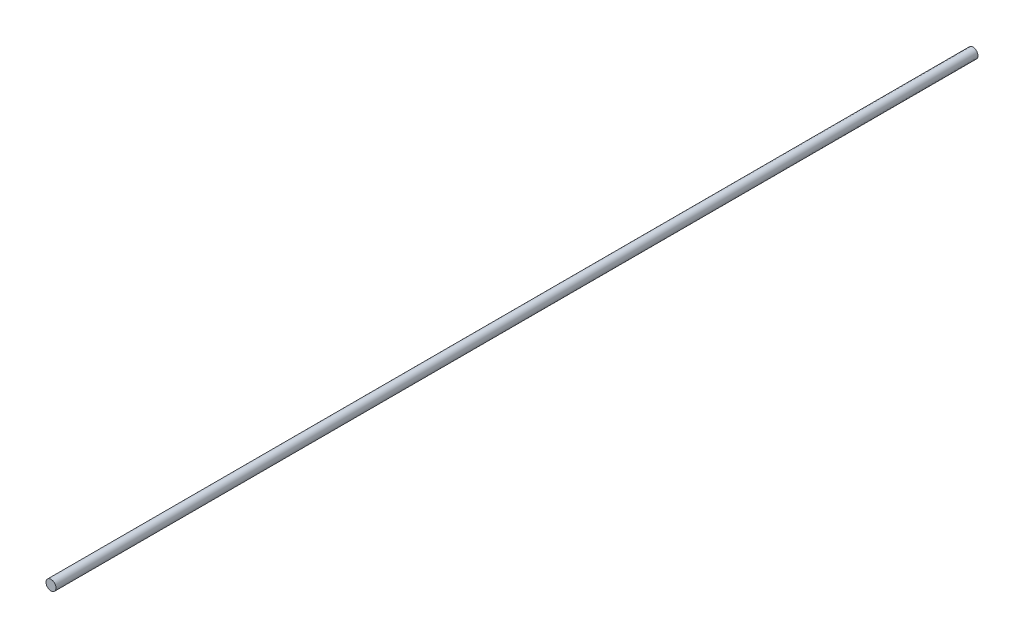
from build123d import *

# Parameters (mm, degrees)
SKETCH1_R           = 6.35
BOSS_EXTRUDE1_DEPTH = 584.2


with BuildPart() as part:
    # Sketch1 → Boss-Extrude1 (new, symmetric)
    with BuildSketch(Plane.XY):
        Circle(SKETCH1_R)
    extrude(amount=BOSS_EXTRUDE1_DEPTH, both=True)


solid = part.part
